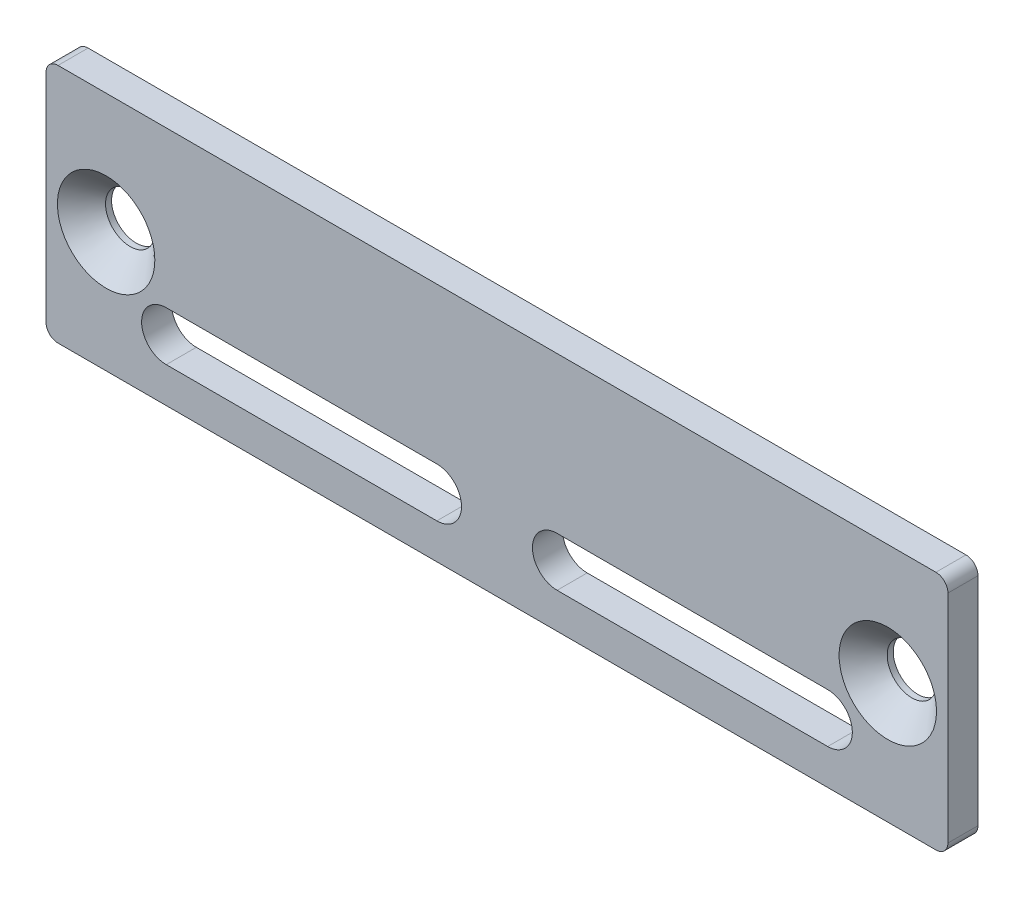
from build123d import *

# Parameters (mm, degrees)
EXTRUDE_1_DEPTH                  = 5
CUT_EXTRUDE_1_DEPTH              = 78.781745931
HOLE_WIZARD_8_2_8_2_1_AT_2_COUNT = 2
HOLE_WIZARD_8_2_8_2_1_AT_2_PITCH = 130


with BuildPart() as part:
    # Sketch 1 → Extrude 1 (new body)
    with BuildSketch(Plane.XY):
        with BuildLine():
            Line((-73, 20), (73, 20))
            ThreePointArc((73, 20), (74.414213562, 19.414213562), (75, 18))
            Line((75, 18), (75, -18))
            ThreePointArc((75, -18), (74.414213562, -19.414213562), (73, -20))
            Line((73, -20), (-73, -20))
            ThreePointArc((-73, -20), (-74.414213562, -19.414213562), (-75, -18))
            Line((-75, -18), (-75, 18))
            ThreePointArc((-75, 18), (-74.414213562, 19.414213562), (-73, 20))
        make_face()
    extrude(amount=EXTRUDE_1_DEPTH)

    # Sketch 2 → Cut-Extrude 1 (cut, through all)
    with BuildSketch(Plane.XY.offset(5)):
        with BuildLine():
            Line((-55, -5.9), (-10, -5.9))
            ThreePointArc((-10, -5.9), (-5.9, -10), (-10, -14.1))
            Line((-10, -14.1), (-55, -14.1))
            ThreePointArc((-55, -14.1), (-59.1, -10), (-55, -5.9))
        make_face()
        with BuildLine():
            Line((55, -5.9), (10, -5.9))
            ThreePointArc((10, -5.9), (5.9, -10), (10, -14.1))
            Line((10, -14.1), (55, -14.1))
            ThreePointArc((55, -14.1), (59.1, -10), (55, -5.9))
        make_face()
    extrude(amount=-CUT_EXTRUDE_1_DEPTH, mode=Mode.SUBTRACT)

    # Sketch 4 → Hole Wizard 8.2 _8.2_1 (revolve, cut)
    with BuildSketch(Plane(origin=(-65, 0, 5), x_dir=(0, -1, 0), z_dir=(1, 0, 0))):
        Polygon((0, 0), (0, 5), (4.1, 5), (4.1, 4), (8.1, 0), align=None)
    hole_wizard_8_2_8_2_1 = revolve(axis=Axis((-65, 0, 11.35), (0, 0, -1)), mode=Mode.SUBTRACT)

    # Hole Wizard 8.2 _8.2_1 at 2: Hole Wizard 8.2 _8.2_1 ×2
    with Locations(*[(i * HOLE_WIZARD_8_2_8_2_1_AT_2_PITCH, 0, 0) for i in range(1, HOLE_WIZARD_8_2_8_2_1_AT_2_COUNT)]):
        add(hole_wizard_8_2_8_2_1, mode=Mode.SUBTRACT)


solid = part.part
